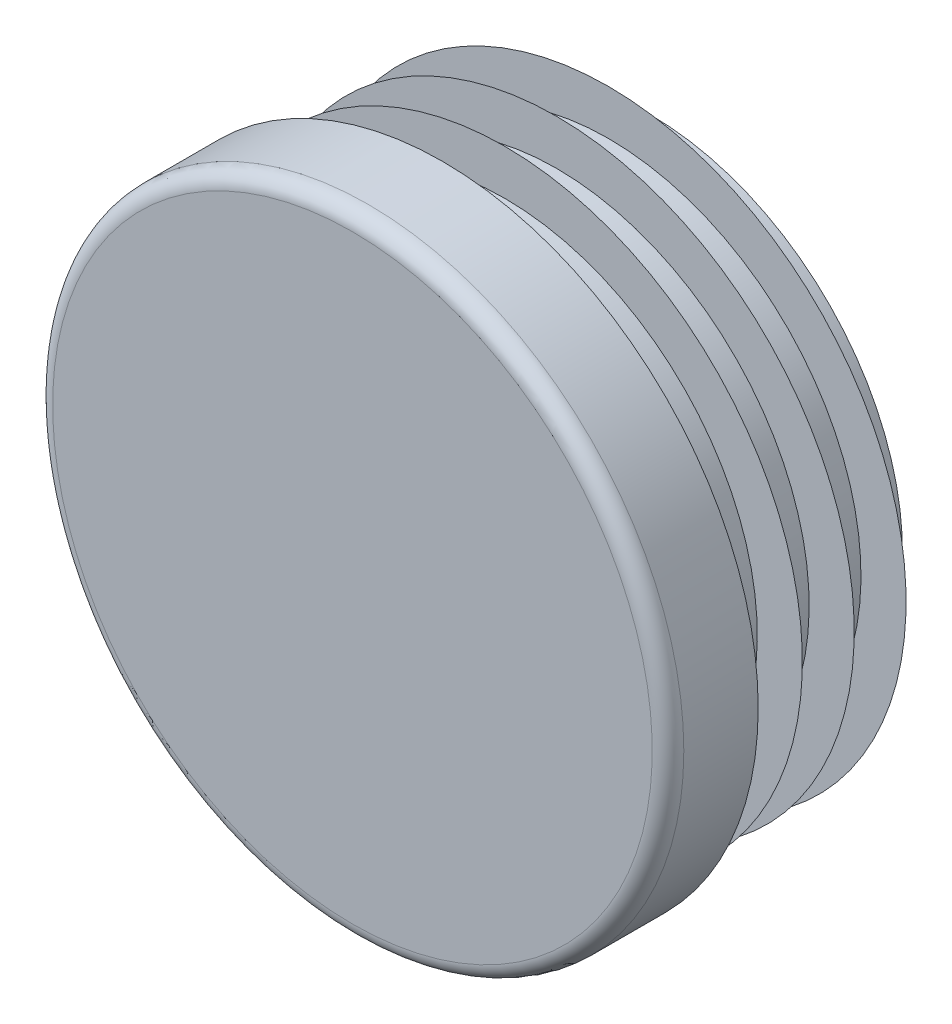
ISO-10303-21;
HEADER;
FILE_DESCRIPTION(('STEP AP214'),'2;1');
FILE_NAME('part.step','',(''),(''),'','','');
FILE_SCHEMA(('AUTOMOTIVE_DESIGN { 1 0 10303 214 1 1 1 1 }'));
ENDSEC;
DATA;
#1=APPLICATION_CONTEXT('core data for automotive mechanical design processes');
#2=APPLICATION_PROTOCOL_DEFINITION('international standard','automotive_design',2000,#1);
#3=PRODUCT_CONTEXT('',#1,'mechanical');
#4=PRODUCT('Part','Part','',(#3));
#5=PRODUCT_RELATED_PRODUCT_CATEGORY('part','',(#4));
#6=PRODUCT_DEFINITION_FORMATION('','',#4);
#7=PRODUCT_DEFINITION_CONTEXT('part definition',#1,'design');
#8=PRODUCT_DEFINITION('design','',#6,#7);
#9=PRODUCT_DEFINITION_SHAPE('','',#8);
#10=(LENGTH_UNIT() NAMED_UNIT(*) SI_UNIT(.MILLI.,.METRE.));
#11=(NAMED_UNIT(*) PLANE_ANGLE_UNIT() SI_UNIT($,.RADIAN.));
#12=(NAMED_UNIT(*) SI_UNIT($,.STERADIAN.) SOLID_ANGLE_UNIT());
#13=UNCERTAINTY_MEASURE_WITH_UNIT(LENGTH_MEASURE(1.E-05),#10,'distance_accuracy_value','');
#14=(GEOMETRIC_REPRESENTATION_CONTEXT(3) GLOBAL_UNCERTAINTY_ASSIGNED_CONTEXT((#13)) GLOBAL_UNIT_ASSIGNED_CONTEXT((#10,
#11,#12)) REPRESENTATION_CONTEXT('',''));
#15=CARTESIAN_POINT('',(0.,0.,0.));
#16=DIRECTION('',(0.,0.,1.));
#17=DIRECTION('',(1.,0.,0.));
#18=AXIS2_PLACEMENT_3D('',#15,#16,#17);
#19=CARTESIAN_POINT('',(0.,0.,5.));
#20=DIRECTION('',(0.,0.,-1.));
#21=DIRECTION('',(0.,1.,0.));
#22=AXIS2_PLACEMENT_3D('',#19,#20,#21);
#23=PLANE('',#22);
#24=CARTESIAN_POINT('',(0.,0.,5.));
#25=DIRECTION('',(0.,0.,-1.));
#26=DIRECTION('',(0.,1.,0.));
#27=AXIS2_PLACEMENT_3D('',#24,#25,#26);
#28=CIRCLE('',#27,16.625);
#29=CARTESIAN_POINT('',(0.,16.625,5.));
#30=VERTEX_POINT('',#29);
#31=EDGE_CURVE('E8',#30,#30,#28,.T.);
#32=ORIENTED_EDGE('',*,*,#31,.F.);
#33=EDGE_LOOP('',(#32));
#34=FACE_BOUND('',#33,.T.);
#35=ADVANCED_FACE('F12',(#34),#23,.F.);
#36=CARTESIAN_POINT('',(0.,0.,4.125));
#37=DIRECTION('',(0.,0.,-1.));
#38=DIRECTION('',(0.,1.,0.));
#39=AXIS2_PLACEMENT_3D('',#36,#37,#38);
#40=TOROIDAL_SURFACE('',#39,16.625,0.875);
#41=ORIENTED_EDGE('',*,*,#31,.T.);
#42=EDGE_LOOP('',(#41));
#43=FACE_BOUND('',#42,.T.);
#44=CARTESIAN_POINT('',(0.,0.,4.12500001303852));
#45=DIRECTION('',(0.,0.,-1.));
#46=DIRECTION('',(0.,1.,0.));
#47=AXIS2_PLACEMENT_3D('',#44,#45,#46);
#48=CIRCLE('',#47,17.5);
#49=CARTESIAN_POINT('',(0.,17.5,4.12500001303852));
#50=VERTEX_POINT('',#49);
#51=EDGE_CURVE('E18',#50,#50,#48,.T.);
#52=ORIENTED_EDGE('',*,*,#51,.F.);
#53=EDGE_LOOP('',(#52));
#54=FACE_BOUND('',#53,.T.);
#55=ADVANCED_FACE('F159',(#43,#54),#40,.T.);
#56=CARTESIAN_POINT('',(0.,0.,-11.5));
#57=DIRECTION('',(0.,0.,-1.));
#58=DIRECTION('',(0.,1.,0.));
#59=AXIS2_PLACEMENT_3D('',#56,#57,#58);
#60=CYLINDRICAL_SURFACE('',#59,17.5);
#61=CARTESIAN_POINT('',(0.,0.,0.));
#62=DIRECTION('',(0.,0.,-1.));
#63=DIRECTION('',(0.,1.,0.));
#64=AXIS2_PLACEMENT_3D('',#61,#62,#63);
#65=CIRCLE('',#64,17.5);
#66=CARTESIAN_POINT('',(0.,17.5,0.));
#67=VERTEX_POINT('',#66);
#68=EDGE_CURVE('E22',#67,#67,#65,.T.);
#69=ORIENTED_EDGE('',*,*,#68,.F.);
#70=EDGE_LOOP('',(#69));
#71=FACE_BOUND('',#70,.T.);
#72=ORIENTED_EDGE('',*,*,#51,.T.);
#73=EDGE_LOOP('',(#72));
#74=FACE_BOUND('',#73,.T.);
#75=ADVANCED_FACE('F154',(#71,#74),#60,.T.);
#76=CARTESIAN_POINT('',(17.5,0.,0.));
#77=DIRECTION('',(0.,0.,1.));
#78=DIRECTION('',(0.,-1.,0.));
#79=AXIS2_PLACEMENT_3D('',#76,#77,#78);
#80=PLANE('',#79);
#81=CARTESIAN_POINT('',(0.,0.,0.));
#82=DIRECTION('',(0.,0.,-1.));
#83=DIRECTION('',(0.,1.,0.));
#84=AXIS2_PLACEMENT_3D('',#81,#82,#83);
#85=CIRCLE('',#84,14.);
#86=CARTESIAN_POINT('',(0.,14.,0.));
#87=VERTEX_POINT('',#86);
#88=EDGE_CURVE('E26',#87,#87,#85,.T.);
#89=ORIENTED_EDGE('',*,*,#88,.F.);
#90=EDGE_LOOP('',(#89));
#91=FACE_BOUND('',#90,.T.);
#92=ORIENTED_EDGE('',*,*,#68,.T.);
#93=EDGE_LOOP('',(#92));
#94=FACE_BOUND('',#93,.T.);
#95=ADVANCED_FACE('F148',(#91,#94),#80,.F.);
#96=CARTESIAN_POINT('',(0.,0.,-11.5));
#97=DIRECTION('',(0.,0.,-1.));
#98=DIRECTION('',(0.,1.,0.));
#99=AXIS2_PLACEMENT_3D('',#96,#97,#98);
#100=CYLINDRICAL_SURFACE('',#99,14.);
#101=CARTESIAN_POINT('',(0.,0.,-0.575));
#102=DIRECTION('',(0.,0.,-1.));
#103=DIRECTION('',(0.,1.,0.));
#104=AXIS2_PLACEMENT_3D('',#101,#102,#103);
#105=CIRCLE('',#104,14.);
#106=CARTESIAN_POINT('',(0.,14.,-0.575));
#107=VERTEX_POINT('',#106);
#108=EDGE_CURVE('E31',#107,#107,#105,.T.);
#109=ORIENTED_EDGE('',*,*,#108,.F.);
#110=EDGE_LOOP('',(#109));
#111=FACE_BOUND('',#110,.T.);
#112=ORIENTED_EDGE('',*,*,#88,.T.);
#113=EDGE_LOOP('',(#112));
#114=FACE_BOUND('',#113,.T.);
#115=ADVANCED_FACE('F142',(#111,#114),#100,.T.);
#116=CARTESIAN_POINT('',(14.,0.,-0.575));
#117=DIRECTION('',(0.,0.,-1.));
#118=DIRECTION('',(0.,1.,0.));
#119=AXIS2_PLACEMENT_3D('',#116,#117,#118);
#120=PLANE('',#119);
#121=CARTESIAN_POINT('',(0.,0.,-0.575));
#122=DIRECTION('',(0.,0.,-1.));
#123=DIRECTION('',(0.,1.,0.));
#124=AXIS2_PLACEMENT_3D('',#121,#122,#123);
#125=CIRCLE('',#124,16.5);
#126=CARTESIAN_POINT('',(0.,16.5,-0.575));
#127=VERTEX_POINT('',#126);
#128=EDGE_CURVE('E34',#127,#127,#125,.T.);
#129=ORIENTED_EDGE('',*,*,#128,.F.);
#130=EDGE_LOOP('',(#129));
#131=FACE_BOUND('',#130,.T.);
#132=ORIENTED_EDGE('',*,*,#108,.T.);
#133=EDGE_LOOP('',(#132));
#134=FACE_BOUND('',#133,.T.);
#135=ADVANCED_FACE('F136',(#131,#134),#120,.F.);
#136=CARTESIAN_POINT('',(0.,0.,-0.575));
#137=DIRECTION('',(0.,0.,1.));
#138=DIRECTION('',(0.,-1.,0.));
#139=AXIS2_PLACEMENT_3D('',#136,#137,#138);
#140=CONICAL_SURFACE('',#139,16.5,0.959931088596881);
#141=CARTESIAN_POINT('',(0.,0.,-2.32551884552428));
#142=DIRECTION('',(0.,0.,-1.));
#143=DIRECTION('',(0.,1.,0.));
#144=AXIS2_PLACEMENT_3D('',#141,#142,#143);
#145=CIRCLE('',#144,14.);
#146=CARTESIAN_POINT('',(0.,14.,-2.32551884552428));
#147=VERTEX_POINT('',#146);
#148=EDGE_CURVE('E37',#147,#147,#145,.T.);
#149=ORIENTED_EDGE('',*,*,#148,.F.);
#150=EDGE_LOOP('',(#149));
#151=FACE_BOUND('',#150,.T.);
#152=ORIENTED_EDGE('',*,*,#128,.T.);
#153=EDGE_LOOP('',(#152));
#154=FACE_BOUND('',#153,.T.);
#155=ADVANCED_FACE('F130',(#151,#154),#140,.T.);
#156=CARTESIAN_POINT('',(0.,0.,-11.5));
#157=DIRECTION('',(0.,0.,-1.));
#158=DIRECTION('',(0.,1.,0.));
#159=AXIS2_PLACEMENT_3D('',#156,#157,#158);
#160=CYLINDRICAL_SURFACE('',#159,14.);
#161=CARTESIAN_POINT('',(0.,0.,-3.45));
#162=DIRECTION('',(0.,0.,-1.));
#163=DIRECTION('',(0.,1.,0.));
#164=AXIS2_PLACEMENT_3D('',#161,#162,#163);
#165=CIRCLE('',#164,14.);
#166=CARTESIAN_POINT('',(0.,14.,-3.45));
#167=VERTEX_POINT('',#166);
#168=EDGE_CURVE('E40',#167,#167,#165,.T.);
#169=ORIENTED_EDGE('',*,*,#168,.F.);
#170=EDGE_LOOP('',(#169));
#171=FACE_BOUND('',#170,.T.);
#172=ORIENTED_EDGE('',*,*,#148,.T.);
#173=EDGE_LOOP('',(#172));
#174=FACE_BOUND('',#173,.T.);
#175=ADVANCED_FACE('F124',(#171,#174),#160,.T.);
#176=CARTESIAN_POINT('',(14.,0.,-3.45));
#177=DIRECTION('',(0.,0.,-1.));
#178=DIRECTION('',(0.,1.,0.));
#179=AXIS2_PLACEMENT_3D('',#176,#177,#178);
#180=PLANE('',#179);
#181=CARTESIAN_POINT('',(0.,0.,-3.45));
#182=DIRECTION('',(0.,0.,-1.));
#183=DIRECTION('',(0.,1.,0.));
#184=AXIS2_PLACEMENT_3D('',#181,#182,#183);
#185=CIRCLE('',#184,16.5);
#186=CARTESIAN_POINT('',(0.,16.5,-3.45));
#187=VERTEX_POINT('',#186);
#188=EDGE_CURVE('E43',#187,#187,#185,.T.);
#189=ORIENTED_EDGE('',*,*,#188,.F.);
#190=EDGE_LOOP('',(#189));
#191=FACE_BOUND('',#190,.T.);
#192=ORIENTED_EDGE('',*,*,#168,.T.);
#193=EDGE_LOOP('',(#192));
#194=FACE_BOUND('',#193,.T.);
#195=ADVANCED_FACE('F118',(#191,#194),#180,.F.);
#196=CARTESIAN_POINT('',(0.,0.,-3.45));
#197=DIRECTION('',(0.,0.,1.));
#198=DIRECTION('',(0.,-1.,0.));
#199=AXIS2_PLACEMENT_3D('',#196,#197,#198);
#200=CONICAL_SURFACE('',#199,16.5,0.959931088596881);
#201=CARTESIAN_POINT('',(0.,0.,-5.20051884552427));
#202=DIRECTION('',(0.,0.,-1.));
#203=DIRECTION('',(0.,1.,0.));
#204=AXIS2_PLACEMENT_3D('',#201,#202,#203);
#205=CIRCLE('',#204,14.);
#206=CARTESIAN_POINT('',(0.,14.,-5.20051884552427));
#207=VERTEX_POINT('',#206);
#208=EDGE_CURVE('E46',#207,#207,#205,.T.);
#209=ORIENTED_EDGE('',*,*,#208,.F.);
#210=EDGE_LOOP('',(#209));
#211=FACE_BOUND('',#210,.T.);
#212=ORIENTED_EDGE('',*,*,#188,.T.);
#213=EDGE_LOOP('',(#212));
#214=FACE_BOUND('',#213,.T.);
#215=ADVANCED_FACE('F112',(#211,#214),#200,.T.);
#216=CARTESIAN_POINT('',(0.,0.,-11.5));
#217=DIRECTION('',(0.,0.,-1.));
#218=DIRECTION('',(0.,1.,0.));
#219=AXIS2_PLACEMENT_3D('',#216,#217,#218);
#220=CYLINDRICAL_SURFACE('',#219,14.);
#221=CARTESIAN_POINT('',(0.,0.,-6.325));
#222=DIRECTION('',(0.,0.,-1.));
#223=DIRECTION('',(0.,1.,0.));
#224=AXIS2_PLACEMENT_3D('',#221,#222,#223);
#225=CIRCLE('',#224,14.);
#226=CARTESIAN_POINT('',(0.,14.,-6.325));
#227=VERTEX_POINT('',#226);
#228=EDGE_CURVE('E49',#227,#227,#225,.T.);
#229=ORIENTED_EDGE('',*,*,#228,.F.);
#230=EDGE_LOOP('',(#229));
#231=FACE_BOUND('',#230,.T.);
#232=ORIENTED_EDGE('',*,*,#208,.T.);
#233=EDGE_LOOP('',(#232));
#234=FACE_BOUND('',#233,.T.);
#235=ADVANCED_FACE('F106',(#231,#234),#220,.T.);
#236=CARTESIAN_POINT('',(14.,0.,-6.325));
#237=DIRECTION('',(0.,0.,-1.));
#238=DIRECTION('',(0.,1.,0.));
#239=AXIS2_PLACEMENT_3D('',#236,#237,#238);
#240=PLANE('',#239);
#241=CARTESIAN_POINT('',(0.,0.,-6.325));
#242=DIRECTION('',(0.,0.,-1.));
#243=DIRECTION('',(0.,1.,0.));
#244=AXIS2_PLACEMENT_3D('',#241,#242,#243);
#245=CIRCLE('',#244,16.5);
#246=CARTESIAN_POINT('',(0.,16.5,-6.325));
#247=VERTEX_POINT('',#246);
#248=EDGE_CURVE('E52',#247,#247,#245,.T.);
#249=ORIENTED_EDGE('',*,*,#248,.F.);
#250=EDGE_LOOP('',(#249));
#251=FACE_BOUND('',#250,.T.);
#252=ORIENTED_EDGE('',*,*,#228,.T.);
#253=EDGE_LOOP('',(#252));
#254=FACE_BOUND('',#253,.T.);
#255=ADVANCED_FACE('F100',(#251,#254),#240,.F.);
#256=CARTESIAN_POINT('',(0.,0.,-6.325));
#257=DIRECTION('',(0.,0.,1.));
#258=DIRECTION('',(0.,-1.,0.));
#259=AXIS2_PLACEMENT_3D('',#256,#257,#258);
#260=CONICAL_SURFACE('',#259,16.5,0.959931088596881);
#261=CARTESIAN_POINT('',(0.,0.,-8.07551884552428));
#262=DIRECTION('',(0.,0.,-1.));
#263=DIRECTION('',(0.,1.,0.));
#264=AXIS2_PLACEMENT_3D('',#261,#262,#263);
#265=CIRCLE('',#264,14.);
#266=CARTESIAN_POINT('',(0.,14.,-8.07551884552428));
#267=VERTEX_POINT('',#266);
#268=EDGE_CURVE('E55',#267,#267,#265,.T.);
#269=ORIENTED_EDGE('',*,*,#268,.F.);
#270=EDGE_LOOP('',(#269));
#271=FACE_BOUND('',#270,.T.);
#272=ORIENTED_EDGE('',*,*,#248,.T.);
#273=EDGE_LOOP('',(#272));
#274=FACE_BOUND('',#273,.T.);
#275=ADVANCED_FACE('F94',(#271,#274),#260,.T.);
#276=CARTESIAN_POINT('',(0.,0.,-11.5));
#277=DIRECTION('',(0.,0.,-1.));
#278=DIRECTION('',(0.,1.,0.));
#279=AXIS2_PLACEMENT_3D('',#276,#277,#278);
#280=CYLINDRICAL_SURFACE('',#279,14.);
#281=CARTESIAN_POINT('',(0.,0.,-9.2));
#282=DIRECTION('',(0.,0.,-1.));
#283=DIRECTION('',(0.,1.,0.));
#284=AXIS2_PLACEMENT_3D('',#281,#282,#283);
#285=CIRCLE('',#284,14.);
#286=CARTESIAN_POINT('',(0.,14.,-9.2));
#287=VERTEX_POINT('',#286);
#288=EDGE_CURVE('E58',#287,#287,#285,.T.);
#289=ORIENTED_EDGE('',*,*,#288,.F.);
#290=EDGE_LOOP('',(#289));
#291=FACE_BOUND('',#290,.T.);
#292=ORIENTED_EDGE('',*,*,#268,.T.);
#293=EDGE_LOOP('',(#292));
#294=FACE_BOUND('',#293,.T.);
#295=ADVANCED_FACE('F88',(#291,#294),#280,.T.);
#296=CARTESIAN_POINT('',(14.,0.,-9.2));
#297=DIRECTION('',(0.,0.,-1.));
#298=DIRECTION('',(0.,1.,0.));
#299=AXIS2_PLACEMENT_3D('',#296,#297,#298);
#300=PLANE('',#299);
#301=CARTESIAN_POINT('',(0.,0.,-9.2));
#302=DIRECTION('',(0.,0.,-1.));
#303=DIRECTION('',(0.,1.,0.));
#304=AXIS2_PLACEMENT_3D('',#301,#302,#303);
#305=CIRCLE('',#304,16.5);
#306=CARTESIAN_POINT('',(0.,16.5,-9.2));
#307=VERTEX_POINT('',#306);
#308=EDGE_CURVE('E61',#307,#307,#305,.T.);
#309=ORIENTED_EDGE('',*,*,#308,.F.);
#310=EDGE_LOOP('',(#309));
#311=FACE_BOUND('',#310,.T.);
#312=ORIENTED_EDGE('',*,*,#288,.T.);
#313=EDGE_LOOP('',(#312));
#314=FACE_BOUND('',#313,.T.);
#315=ADVANCED_FACE('F82',(#311,#314),#300,.F.);
#316=CARTESIAN_POINT('',(0.,0.,-9.2));
#317=DIRECTION('',(0.,0.,1.));
#318=DIRECTION('',(0.,-1.,0.));
#319=AXIS2_PLACEMENT_3D('',#316,#317,#318);
#320=CONICAL_SURFACE('',#319,16.5,0.959931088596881);
#321=CARTESIAN_POINT('',(0.,0.,-10.9505188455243));
#322=DIRECTION('',(0.,0.,-1.));
#323=DIRECTION('',(0.,1.,0.));
#324=AXIS2_PLACEMENT_3D('',#321,#322,#323);
#325=CIRCLE('',#324,14.);
#326=CARTESIAN_POINT('',(0.,14.,-10.9505188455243));
#327=VERTEX_POINT('',#326);
#328=EDGE_CURVE('E64',#327,#327,#325,.T.);
#329=ORIENTED_EDGE('',*,*,#328,.F.);
#330=EDGE_LOOP('',(#329));
#331=FACE_BOUND('',#330,.T.);
#332=ORIENTED_EDGE('',*,*,#308,.T.);
#333=EDGE_LOOP('',(#332));
#334=FACE_BOUND('',#333,.T.);
#335=ADVANCED_FACE('F76',(#331,#334),#320,.T.);
#336=CARTESIAN_POINT('',(0.,0.,-11.5));
#337=DIRECTION('',(0.,0.,-1.));
#338=DIRECTION('',(0.,1.,0.));
#339=AXIS2_PLACEMENT_3D('',#336,#337,#338);
#340=CYLINDRICAL_SURFACE('',#339,14.);
#341=CARTESIAN_POINT('',(0.,0.,-11.5));
#342=DIRECTION('',(0.,0.,-1.));
#343=DIRECTION('',(0.,1.,0.));
#344=AXIS2_PLACEMENT_3D('',#341,#342,#343);
#345=CIRCLE('',#344,14.);
#346=CARTESIAN_POINT('',(0.,14.,-11.5));
#347=VERTEX_POINT('',#346);
#348=EDGE_CURVE('E67',#347,#347,#345,.T.);
#349=ORIENTED_EDGE('',*,*,#348,.F.);
#350=EDGE_LOOP('',(#349));
#351=FACE_BOUND('',#350,.T.);
#352=ORIENTED_EDGE('',*,*,#328,.T.);
#353=EDGE_LOOP('',(#352));
#354=FACE_BOUND('',#353,.T.);
#355=ADVANCED_FACE('F73',(#351,#354),#340,.T.);
#356=CARTESIAN_POINT('',(14.,0.,-11.5));
#357=DIRECTION('',(0.,0.,1.));
#358=DIRECTION('',(0.,-1.,0.));
#359=AXIS2_PLACEMENT_3D('',#356,#357,#358);
#360=PLANE('',#359);
#361=ORIENTED_EDGE('',*,*,#348,.T.);
#362=EDGE_LOOP('',(#361));
#363=FACE_BOUND('',#362,.T.);
#364=ADVANCED_FACE('F71',(#363),#360,.F.);
#365=CLOSED_SHELL('',(#35,#55,#75,#95,#115,#135,#155,#175,#195,#215,#235,#255,#275,#295,#315,
#335,#355,#364));
#366=MANIFOLD_SOLID_BREP('B1',#365);
#367=ADVANCED_BREP_SHAPE_REPRESENTATION('',(#18,#366),#14);
#368=SHAPE_DEFINITION_REPRESENTATION(#9,#367);
ENDSEC;
END-ISO-10303-21;
